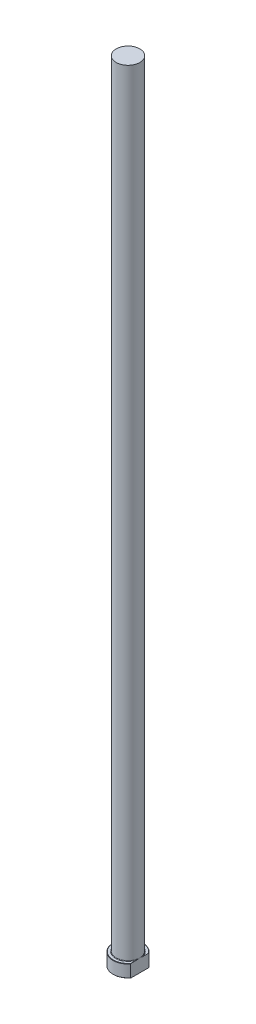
ISO-10303-21;
HEADER;
FILE_DESCRIPTION(('STEP AP214'),'2;1');
FILE_NAME('part.step','',(''),(''),'','','');
FILE_SCHEMA(('AUTOMOTIVE_DESIGN { 1 0 10303 214 1 1 1 1 }'));
ENDSEC;
DATA;
#1=APPLICATION_CONTEXT('core data for automotive mechanical design processes');
#2=APPLICATION_PROTOCOL_DEFINITION('international standard','automotive_design',2000,#1);
#3=PRODUCT_CONTEXT('',#1,'mechanical');
#4=PRODUCT('Part','Part','',(#3));
#5=PRODUCT_RELATED_PRODUCT_CATEGORY('part','',(#4));
#6=PRODUCT_DEFINITION_FORMATION('','',#4);
#7=PRODUCT_DEFINITION_CONTEXT('part definition',#1,'design');
#8=PRODUCT_DEFINITION('design','',#6,#7);
#9=PRODUCT_DEFINITION_SHAPE('','',#8);
#10=(LENGTH_UNIT() NAMED_UNIT(*) SI_UNIT(.MILLI.,.METRE.));
#11=(NAMED_UNIT(*) PLANE_ANGLE_UNIT() SI_UNIT($,.RADIAN.));
#12=(NAMED_UNIT(*) SI_UNIT($,.STERADIAN.) SOLID_ANGLE_UNIT());
#13=UNCERTAINTY_MEASURE_WITH_UNIT(LENGTH_MEASURE(1.E-05),#10,'distance_accuracy_value','');
#14=(GEOMETRIC_REPRESENTATION_CONTEXT(3) GLOBAL_UNCERTAINTY_ASSIGNED_CONTEXT((#13)) GLOBAL_UNIT_ASSIGNED_CONTEXT((#10,
#11,#12)) REPRESENTATION_CONTEXT('',''));
#15=CARTESIAN_POINT('',(0.,0.,0.));
#16=DIRECTION('',(0.,0.,1.));
#17=DIRECTION('',(1.,0.,0.));
#18=AXIS2_PLACEMENT_3D('',#15,#16,#17);
#19=CARTESIAN_POINT('',(0.,0.,0.));
#20=DIRECTION('',(0.,-1.,0.));
#21=DIRECTION('',(0.,0.,-1.));
#22=AXIS2_PLACEMENT_3D('',#19,#20,#21);
#23=PLANE('',#22);
#24=CARTESIAN_POINT('',(0.,0.,0.));
#25=DIRECTION('',(0.,-1.,0.));
#26=DIRECTION('',(0.,0.,-1.));
#27=AXIS2_PLACEMENT_3D('',#24,#25,#26);
#28=CIRCLE('',#27,9.29999999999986);
#29=CARTESIAN_POINT('',(7.49999999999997,0.,5.49909083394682));
#30=VERTEX_POINT('',#29);
#31=CARTESIAN_POINT('',(7.49999999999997,0.,-5.49909083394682));
#32=VERTEX_POINT('',#31);
#33=EDGE_CURVE('E98',#30,#32,#28,.T.);
#34=ORIENTED_EDGE('',*,*,#33,.T.);
#35=DIRECTION('',(0.,0.,1.));
#36=VECTOR('',#35,1.);
#37=CARTESIAN_POINT('',(7.49999999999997,0.,5.83095189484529));
#38=LINE('',#37,#36);
#39=EDGE_CURVE('E83',#32,#30,#38,.T.);
#40=ORIENTED_EDGE('',*,*,#39,.T.);
#41=EDGE_LOOP('',(#34,#40));
#42=FACE_BOUND('',#41,.T.);
#43=ADVANCED_FACE('F32',(#42),#23,.T.);
#44=CARTESIAN_POINT('',(0.,259.958771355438,0.));
#45=DIRECTION('',(0.,1.,0.));
#46=DIRECTION('',(0.,0.,1.));
#47=AXIS2_PLACEMENT_3D('',#44,#45,#46);
#48=CYLINDRICAL_SURFACE('',#47,9.49999999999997);
#49=CARTESIAN_POINT('',(0.,7.79999999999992,0.));
#50=DIRECTION('',(0.,1.,0.));
#51=DIRECTION('',(0.,0.,1.));
#52=AXIS2_PLACEMENT_3D('',#49,#50,#51);
#53=CIRCLE('',#52,9.49999999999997);
#54=CARTESIAN_POINT('',(7.49999999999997,7.79999999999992,5.83095189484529));
#55=VERTEX_POINT('',#54);
#56=CARTESIAN_POINT('',(7.49999999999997,7.79999999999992,-5.83095189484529));
#57=VERTEX_POINT('',#56);
#58=EDGE_CURVE('E104',#55,#57,#53,.F.);
#59=ORIENTED_EDGE('',*,*,#58,.T.);
#60=DIRECTION('',(0.,-1.,0.));
#61=VECTOR('',#60,1.);
#62=CARTESIAN_POINT('',(7.49999999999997,500.,-5.83095189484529));
#63=LINE('',#62,#61);
#64=CARTESIAN_POINT('',(7.49999999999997,0.200000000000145,-5.83095189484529));
#65=VERTEX_POINT('',#64);
#66=EDGE_CURVE('E183',#57,#65,#63,.T.);
#67=ORIENTED_EDGE('',*,*,#66,.T.);
#68=CARTESIAN_POINT('',(0.,0.200000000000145,0.));
#69=DIRECTION('',(0.,-1.,0.));
#70=DIRECTION('',(0.,0.,-1.));
#71=AXIS2_PLACEMENT_3D('',#68,#69,#70);
#72=CIRCLE('',#71,9.49999999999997);
#73=CARTESIAN_POINT('',(7.49999999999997,0.200000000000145,5.83095189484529));
#74=VERTEX_POINT('',#73);
#75=EDGE_CURVE('E100',#65,#74,#72,.F.);
#76=ORIENTED_EDGE('',*,*,#75,.T.);
#77=DIRECTION('',(0.,-1.,0.));
#78=VECTOR('',#77,1.);
#79=CARTESIAN_POINT('',(7.49999999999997,500.,5.83095189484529));
#80=LINE('',#79,#78);
#81=EDGE_CURVE('E93',#55,#74,#80,.T.);
#82=ORIENTED_EDGE('',*,*,#81,.F.);
#83=EDGE_LOOP('',(#59,#67,#76,#82));
#84=FACE_BOUND('',#83,.T.);
#85=ADVANCED_FACE('F158',(#84),#48,.T.);
#86=CARTESIAN_POINT('',(-9.49999999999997,8.,0.));
#87=DIRECTION('',(0.,1.,0.));
#88=DIRECTION('',(0.,0.,1.));
#89=AXIS2_PLACEMENT_3D('',#86,#87,#88);
#90=PLANE('',#89);
#91=CARTESIAN_POINT('',(0.,8.,0.));
#92=DIRECTION('',(0.,1.,0.));
#93=DIRECTION('',(0.,0.,1.));
#94=AXIS2_PLACEMENT_3D('',#91,#92,#93);
#95=CIRCLE('',#94,9.29999999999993);
#96=CARTESIAN_POINT('',(7.49999999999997,8.,-5.49909083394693));
#97=VERTEX_POINT('',#96);
#98=CARTESIAN_POINT('',(7.49999999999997,8.,5.49909083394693));
#99=VERTEX_POINT('',#98);
#100=EDGE_CURVE('E178',#97,#99,#95,.T.);
#101=ORIENTED_EDGE('',*,*,#100,.T.);
#102=DIRECTION('',(0.,0.,-1.));
#103=VECTOR('',#102,1.);
#104=CARTESIAN_POINT('',(7.49999999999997,8.,0.));
#105=LINE('',#104,#103);
#106=CARTESIAN_POINT('',(7.49999999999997,7.99999999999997,2.14242852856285));
#107=VERTEX_POINT('',#106);
#108=EDGE_CURVE('E57',#99,#107,#105,.T.);
#109=ORIENTED_EDGE('',*,*,#108,.T.);
#110=CARTESIAN_POINT('',(0.,8.,0.));
#111=DIRECTION('',(0.,1.,0.));
#112=DIRECTION('',(0.,0.,1.));
#113=AXIS2_PLACEMENT_3D('',#110,#111,#112);
#114=CIRCLE('',#113,7.79999999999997);
#115=CARTESIAN_POINT('',(7.49999999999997,7.99999999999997,-2.14242852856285));
#116=VERTEX_POINT('',#115);
#117=EDGE_CURVE('E107',#107,#116,#114,.F.);
#118=ORIENTED_EDGE('',*,*,#117,.T.);
#119=EDGE_CURVE('E136',#116,#97,#105,.T.);
#120=ORIENTED_EDGE('',*,*,#119,.T.);
#121=EDGE_LOOP('',(#101,#109,#118,#120));
#122=FACE_BOUND('',#121,.T.);
#123=ADVANCED_FACE('F147',(#122),#90,.T.);
#124=CARTESIAN_POINT('',(0.,8.00000000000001,0.));
#125=DIRECTION('',(0.,-1.,0.));
#126=DIRECTION('',(0.,0.,-1.));
#127=AXIS2_PLACEMENT_3D('',#124,#125,#126);
#128=CONICAL_SURFACE('',#127,9.29999999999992,0.785398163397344);
#129=ORIENTED_EDGE('',*,*,#58,.F.);
#130=CARTESIAN_POINT('',(7.49999999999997,2.43926210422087,12.8293230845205));
#131=CARTESIAN_POINT('',(7.49999999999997,2.6036817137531,12.6388640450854));
#132=CARTESIAN_POINT('',(7.49999999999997,2.76757220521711,12.4479485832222));
#133=CARTESIAN_POINT('',(7.49999999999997,3.09414752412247,12.0650837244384));
#134=CARTESIAN_POINT('',(7.49999999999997,3.25683233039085,11.8731343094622));
#135=CARTESIAN_POINT('',(7.49999999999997,3.74300314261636,11.2953796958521));
#136=CARTESIAN_POINT('',(7.49999999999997,4.06444825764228,10.9078497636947));
#137=CARTESIAN_POINT('',(7.49999999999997,4.70797958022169,10.1174567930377));
#138=CARTESIAN_POINT('',(7.49999999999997,5.02989003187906,9.71445035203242));
#139=CARTESIAN_POINT('',(7.49999999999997,5.66358170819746,8.90065355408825));
#140=CARTESIAN_POINT('',(7.49999999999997,5.97536547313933,8.48986519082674));
#141=CARTESIAN_POINT('',(7.49999999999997,6.43271321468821,7.86561279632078));
#142=CARTESIAN_POINT('',(7.49999999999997,6.58355573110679,7.65601562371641));
#143=CARTESIAN_POINT('',(7.49999999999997,6.88098805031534,7.23383023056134));
#144=CARTESIAN_POINT('',(7.49999999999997,7.02757803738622,7.02124214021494));
#145=CARTESIAN_POINT('',(7.49999999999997,7.3157717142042,6.59242303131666));
#146=CARTESIAN_POINT('',(7.49999999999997,7.45737076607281,6.37618888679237));
#147=CARTESIAN_POINT('',(7.49999999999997,7.73432379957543,5.93974874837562));
#148=CARTESIAN_POINT('',(7.49999999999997,7.86967791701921,5.71954284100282));
#149=CARTESIAN_POINT('',(7.49999999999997,8.13161422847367,5.27645352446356));
#150=CARTESIAN_POINT('',(7.49999999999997,8.25826072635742,5.05360831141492));
#151=CARTESIAN_POINT('',(7.49999999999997,8.5022686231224,4.60282545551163));
#152=CARTESIAN_POINT('',(7.49999999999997,8.61962890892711,4.37488720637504));
#153=CARTESIAN_POINT('',(7.49999999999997,8.84265212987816,3.91374424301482));
#154=CARTESIAN_POINT('',(7.49999999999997,8.94833271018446,3.68054813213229));
#155=CARTESIAN_POINT('',(7.49999999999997,9.14543751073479,3.20825593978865));
#156=CARTESIAN_POINT('',(7.49999999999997,9.23686734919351,2.96916222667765));
#157=CARTESIAN_POINT('',(7.49999999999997,9.40433943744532,2.47905851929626));
#158=CARTESIAN_POINT('',(7.49999999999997,9.47995361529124,2.22790013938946));
#159=CARTESIAN_POINT('',(7.49999999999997,9.60922868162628,1.71994305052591));
#160=CARTESIAN_POINT('',(7.49999999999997,9.66289308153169,1.46314525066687));
#161=CARTESIAN_POINT('',(7.49999999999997,9.74472710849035,0.946918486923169));
#162=CARTESIAN_POINT('',(7.49999999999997,9.77303822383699,0.687512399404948));
#163=CARTESIAN_POINT('',(7.49999999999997,9.80263328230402,0.167149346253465));
#164=CARTESIAN_POINT('',(7.49999999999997,9.80391935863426,-0.0938074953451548));
#165=CARTESIAN_POINT('',(7.49999999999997,9.77936899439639,-0.614450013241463));
#166=CARTESIAN_POINT('',(7.49999999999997,9.75352879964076,-0.874135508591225));
#167=CARTESIAN_POINT('',(7.49999999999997,9.67659985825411,-1.38971001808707));
#168=CARTESIAN_POINT('',(7.49999999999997,9.62550644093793,-1.64559832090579));
#169=CARTESIAN_POINT('',(7.49999999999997,9.50084859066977,-2.15357163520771));
#170=CARTESIAN_POINT('',(7.49999999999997,9.42713551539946,-2.4056195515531));
#171=CARTESIAN_POINT('',(7.49999999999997,9.26105658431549,-2.90339454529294));
#172=CARTESIAN_POINT('',(7.49999999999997,9.16869086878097,-3.14912167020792));
#173=CARTESIAN_POINT('',(7.49999999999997,8.94289805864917,-3.69711942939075));
#174=CARTESIAN_POINT('',(7.49999999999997,8.80503243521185,-3.99754721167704));
#175=CARTESIAN_POINT('',(7.49999999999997,8.51100220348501,-4.589388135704));
#176=CARTESIAN_POINT('',(7.49999999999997,8.35482676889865,-4.88079581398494));
#177=CARTESIAN_POINT('',(7.49999999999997,8.02827429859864,-5.45629308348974));
#178=CARTESIAN_POINT('',(7.49999999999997,7.85786790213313,-5.74036587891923));
#179=CARTESIAN_POINT('',(7.49999999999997,7.50643147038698,-6.30173438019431));
#180=CARTESIAN_POINT('',(7.49999999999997,7.32540361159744,-6.57903145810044));
#181=CARTESIAN_POINT('',(7.49999999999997,6.95412130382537,-7.12942244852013));
#182=CARTESIAN_POINT('',(7.49999999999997,6.76382431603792,-7.40248752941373));
#183=CARTESIAN_POINT('',(7.49999999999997,6.37663930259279,-7.9439029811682));
#184=CARTESIAN_POINT('',(7.49999999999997,6.17975101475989,-8.21225316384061));
#185=CARTESIAN_POINT('',(7.49999999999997,5.78094463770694,-8.74469530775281));
#186=CARTESIAN_POINT('',(7.49999999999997,5.57903261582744,-9.00879182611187));
#187=CARTESIAN_POINT('',(7.49999999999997,5.17096183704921,-9.53366660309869));
#188=CARTESIAN_POINT('',(7.49999999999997,4.96480317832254,-9.79444493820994));
#189=CARTESIAN_POINT('',(7.49999999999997,4.56753982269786,-10.2900670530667));
#190=CARTESIAN_POINT('',(7.49999999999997,4.37673236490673,-10.5251495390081));
#191=CARTESIAN_POINT('',(7.49999999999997,3.9926419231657,-10.9933477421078));
#192=CARTESIAN_POINT('',(7.49999999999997,3.7993585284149,-11.2264631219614));
#193=CARTESIAN_POINT('',(7.49999999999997,3.41257456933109,-11.6887329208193));
#194=CARTESIAN_POINT('',(7.49999999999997,3.21909377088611,-11.9179038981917));
#195=CARTESIAN_POINT('',(7.49999999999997,2.83040955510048,-12.3747052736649));
#196=CARTESIAN_POINT('',(7.49999999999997,2.63520647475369,-12.6023359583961));
#197=CARTESIAN_POINT('',(7.49999999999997,2.43926210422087,-12.8293230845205));
#198=B_SPLINE_CURVE_WITH_KNOTS('',3,(#130,#131,#132,#133,#134,#135,#136,#137,#138,#139,#140,
#141,#142,#143,#144,#145,#146,#147,#148,#149,#150,#151,#152,#153,#154,#155,#156,#157,#158,#159,
#160,#161,#162,#163,#164,#165,#166,#167,#168,#169,#170,#171,#172,#173,#174,#175,#176,#177,#178,
#179,#180,#181,#182,#183,#184,#185,#186,#187,#188,#189,#190,#191,#192,#193,#194,#195,#196,#197),
.UNSPECIFIED.,.F.,.F.,(4,2,2,2,2,2,2,2,2,2,2,2,2,2,2,2,2,2,2,2,2,2,2,2,2,2,2,2,2,2,2,2,2,4),(0.,
0.754832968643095,1.50967916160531,3.02009230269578,4.56736183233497,6.11424018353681,
6.88889911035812,7.66352441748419,8.43885153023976,9.2141617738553,9.9829390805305,
10.7518083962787,11.5194997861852,12.2868877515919,13.0729296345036,13.8588457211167,
14.6403480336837,15.4217886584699,16.203337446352,16.9850308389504,17.7719752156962,
18.5589136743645,19.5497136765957,20.5411025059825,21.5345898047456,22.5278742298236,
23.5262502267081,24.5246659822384,25.5219294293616,26.5191698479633,27.4274691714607,
28.3359212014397,29.2356826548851,30.1352717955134),.UNSPECIFIED.);
#199=EDGE_CURVE('E135',#55,#99,#198,.T.);
#200=ORIENTED_EDGE('',*,*,#199,.T.);
#201=ORIENTED_EDGE('',*,*,#100,.F.);
#202=EDGE_CURVE('E127',#97,#57,#198,.T.);
#203=ORIENTED_EDGE('',*,*,#202,.T.);
#204=EDGE_LOOP('',(#129,#200,#201,#203));
#205=FACE_BOUND('',#204,.T.);
#206=ADVANCED_FACE('F143',(#205),#128,.T.);
#207=CARTESIAN_POINT('',(0.,0.200000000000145,0.));
#208=DIRECTION('',(0.,1.,0.));
#209=DIRECTION('',(0.,0.,1.));
#210=AXIS2_PLACEMENT_3D('',#207,#208,#209);
#211=CONICAL_SURFACE('',#210,9.49999999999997,0.785398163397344);
#212=ORIENTED_EDGE('',*,*,#75,.F.);
#213=CARTESIAN_POINT('',(7.49999999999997,5.56073789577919,-12.8293230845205));
#214=CARTESIAN_POINT('',(7.49999999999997,5.39631828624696,-12.6388640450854));
#215=CARTESIAN_POINT('',(7.49999999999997,5.23242779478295,-12.4479485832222));
#216=CARTESIAN_POINT('',(7.49999999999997,4.90585247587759,-12.0650837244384));
#217=CARTESIAN_POINT('',(7.49999999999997,4.74316766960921,-11.8731343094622));
#218=CARTESIAN_POINT('',(7.49999999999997,4.2569968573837,-11.2953796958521));
#219=CARTESIAN_POINT('',(7.49999999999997,3.93555174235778,-10.9078497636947));
#220=CARTESIAN_POINT('',(7.49999999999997,3.29202041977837,-10.1174567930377));
#221=CARTESIAN_POINT('',(7.49999999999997,2.970109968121,-9.71445035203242));
#222=CARTESIAN_POINT('',(7.49999999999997,2.33641829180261,-8.90065355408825));
#223=CARTESIAN_POINT('',(7.49999999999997,2.02463452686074,-8.48986519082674));
#224=CARTESIAN_POINT('',(7.49999999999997,1.56728678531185,-7.86561279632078));
#225=CARTESIAN_POINT('',(7.49999999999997,1.41644426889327,-7.65601562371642));
#226=CARTESIAN_POINT('',(7.49999999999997,1.11901194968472,-7.23383023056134));
#227=CARTESIAN_POINT('',(7.49999999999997,0.972421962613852,-7.02124214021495));
#228=CARTESIAN_POINT('',(7.49999999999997,0.68422828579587,-6.59242303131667));
#229=CARTESIAN_POINT('',(7.49999999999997,0.542629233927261,-6.37618888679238));
#230=CARTESIAN_POINT('',(7.49999999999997,0.26567620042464,-5.93974874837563));
#231=CARTESIAN_POINT('',(7.49999999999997,0.130322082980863,-5.71954284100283));
#232=CARTESIAN_POINT('',(7.49999999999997,-0.131614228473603,-5.27645352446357));
#233=CARTESIAN_POINT('',(7.49999999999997,-0.25826072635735,-5.05360831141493));
#234=CARTESIAN_POINT('',(7.49999999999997,-0.502268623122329,-4.60282545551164));
#235=CARTESIAN_POINT('',(7.49999999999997,-0.619628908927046,-4.37488720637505));
#236=CARTESIAN_POINT('',(7.49999999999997,-0.842652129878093,-3.91374424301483));
#237=CARTESIAN_POINT('',(7.49999999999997,-0.948332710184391,-3.6805481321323));
#238=CARTESIAN_POINT('',(7.49999999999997,-1.14543751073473,-3.20825593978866));
#239=CARTESIAN_POINT('',(7.49999999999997,-1.23686734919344,-2.96916222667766));
#240=CARTESIAN_POINT('',(7.49999999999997,-1.40433943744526,-2.47905851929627));
#241=CARTESIAN_POINT('',(7.49999999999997,-1.47995361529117,-2.22790013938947));
#242=CARTESIAN_POINT('',(7.49999999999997,-1.60922868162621,-1.71994305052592));
#243=CARTESIAN_POINT('',(7.49999999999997,-1.66289308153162,-1.46314525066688));
#244=CARTESIAN_POINT('',(7.49999999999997,-1.74472710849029,-0.946918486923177));
#245=CARTESIAN_POINT('',(7.49999999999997,-1.77303822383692,-0.687512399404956));
#246=CARTESIAN_POINT('',(7.49999999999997,-1.80263328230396,-0.167149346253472));
#247=CARTESIAN_POINT('',(7.49999999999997,-1.80391935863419,0.0938074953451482));
#248=CARTESIAN_POINT('',(7.49999999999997,-1.77936899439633,0.614450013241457));
#249=CARTESIAN_POINT('',(7.49999999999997,-1.7535287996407,0.874135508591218));
#250=CARTESIAN_POINT('',(7.49999999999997,-1.67659985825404,1.38971001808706));
#251=CARTESIAN_POINT('',(7.49999999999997,-1.62550644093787,1.64559832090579));
#252=CARTESIAN_POINT('',(7.49999999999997,-1.5008485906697,2.15357163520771));
#253=CARTESIAN_POINT('',(7.49999999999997,-1.4271355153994,2.40561955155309));
#254=CARTESIAN_POINT('',(7.49999999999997,-1.26105658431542,2.90339454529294));
#255=CARTESIAN_POINT('',(7.49999999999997,-1.1686908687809,3.14912167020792));
#256=CARTESIAN_POINT('',(7.49999999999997,-0.942898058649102,3.69711942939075));
#257=CARTESIAN_POINT('',(7.49999999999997,-0.805032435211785,3.99754721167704));
#258=CARTESIAN_POINT('',(7.49999999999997,-0.511002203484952,4.589388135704));
#259=CARTESIAN_POINT('',(7.49999999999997,-0.354826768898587,4.88079581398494));
#260=CARTESIAN_POINT('',(7.49999999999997,-0.028274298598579,5.45629308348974));
#261=CARTESIAN_POINT('',(7.49999999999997,0.142132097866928,5.74036587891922));
#262=CARTESIAN_POINT('',(7.49999999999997,0.493568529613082,6.30173438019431));
#263=CARTESIAN_POINT('',(7.49999999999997,0.674596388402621,6.57903145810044));
#264=CARTESIAN_POINT('',(7.49999999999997,1.04587869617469,7.12942244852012));
#265=CARTESIAN_POINT('',(7.49999999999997,1.23617568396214,7.40248752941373));
#266=CARTESIAN_POINT('',(7.49999999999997,1.62336069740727,7.9439029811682));
#267=CARTESIAN_POINT('',(7.49999999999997,1.82024898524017,8.2122531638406));
#268=CARTESIAN_POINT('',(7.49999999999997,2.21905536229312,8.74469530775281));
#269=CARTESIAN_POINT('',(7.49999999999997,2.42096738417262,9.00879182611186));
#270=CARTESIAN_POINT('',(7.49999999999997,2.82903816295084,9.53366660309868));
#271=CARTESIAN_POINT('',(7.49999999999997,3.03519682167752,9.79444493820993));
#272=CARTESIAN_POINT('',(7.49999999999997,3.4324601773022,10.2900670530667));
#273=CARTESIAN_POINT('',(7.49999999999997,3.62326763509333,10.5251495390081));
#274=CARTESIAN_POINT('',(7.49999999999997,4.00735807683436,10.9933477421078));
#275=CARTESIAN_POINT('',(7.49999999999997,4.20064147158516,11.2264631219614));
#276=CARTESIAN_POINT('',(7.49999999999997,4.58742543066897,11.6887329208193));
#277=CARTESIAN_POINT('',(7.49999999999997,4.78090622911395,11.9179038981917));
#278=CARTESIAN_POINT('',(7.49999999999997,5.16959044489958,12.3747052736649));
#279=CARTESIAN_POINT('',(7.49999999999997,5.36479352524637,12.6023359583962));
#280=CARTESIAN_POINT('',(7.49999999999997,5.56073789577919,12.8293230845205));
#281=B_SPLINE_CURVE_WITH_KNOTS('',3,(#213,#214,#215,#216,#217,#218,#219,#220,#221,#222,#223,
#224,#225,#226,#227,#228,#229,#230,#231,#232,#233,#234,#235,#236,#237,#238,#239,#240,#241,#242,
#243,#244,#245,#246,#247,#248,#249,#250,#251,#252,#253,#254,#255,#256,#257,#258,#259,#260,#261,
#262,#263,#264,#265,#266,#267,#268,#269,#270,#271,#272,#273,#274,#275,#276,#277,#278,#279,#280),
.UNSPECIFIED.,.F.,.F.,(4,2,2,2,2,2,2,2,2,2,2,2,2,2,2,2,2,2,2,2,2,2,2,2,2,2,2,2,2,2,2,2,2,4),(0.,
0.754832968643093,1.50967916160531,3.02009230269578,4.56736183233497,6.1142401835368,
6.88889911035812,7.66352441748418,8.43885153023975,9.2141617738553,9.98293908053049,
10.7518083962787,11.5194997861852,12.2868877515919,13.0729296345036,13.8588457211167,
14.6403480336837,15.4217886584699,16.203337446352,16.9850308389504,17.7719752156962,
18.5589136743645,19.5497136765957,20.5411025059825,21.5345898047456,22.5278742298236,
23.5262502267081,24.5246659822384,25.5219294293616,26.5191698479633,27.4274691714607,
28.3359212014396,29.2356826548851,30.1352717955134),.UNSPECIFIED.);
#282=EDGE_CURVE('E86',#65,#32,#281,.T.);
#283=ORIENTED_EDGE('',*,*,#282,.T.);
#284=ORIENTED_EDGE('',*,*,#33,.F.);
#285=EDGE_CURVE('E89',#30,#74,#281,.T.);
#286=ORIENTED_EDGE('',*,*,#285,.T.);
#287=EDGE_LOOP('',(#212,#283,#284,#286));
#288=FACE_BOUND('',#287,.T.);
#289=ADVANCED_FACE('F97',(#288),#211,.T.);
#290=CARTESIAN_POINT('',(0.,8.29999999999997,0.));
#291=DIRECTION('',(0.,1.,0.));
#292=DIRECTION('',(0.,0.,1.));
#293=AXIS2_PLACEMENT_3D('',#290,#291,#292);
#294=TOROIDAL_SURFACE('',#293,7.79999999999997,0.3);
#295=CARTESIAN_POINT('',(7.49999999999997,8.29999999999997,0.));
#296=CARTESIAN_POINT('',(7.49999999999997,8.300000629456,-6.51608939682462E-11));
#297=CARTESIAN_POINT('',(7.49999999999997,8.30000125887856,-3.32214421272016E-07));
#298=CARTESIAN_POINT('',(7.49999999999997,8.30000242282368,-1.19350016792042E-06));
#299=CARTESIAN_POINT('',(7.49999999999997,8.300002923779,-1.74631658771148E-06));
#300=CARTESIAN_POINT('',(7.49999999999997,8.3000040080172,-3.08939560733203E-06));
#301=CARTESIAN_POINT('',(7.49999999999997,8.30000457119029,-3.9012580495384E-06));
#302=CARTESIAN_POINT('',(7.49999999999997,8.3000055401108,-5.54513098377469E-06));
#303=CARTESIAN_POINT('',(7.49999999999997,8.30000595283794,-6.37354880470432E-06));
#304=CARTESIAN_POINT('',(7.49999999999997,8.3000075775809,-9.72270005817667E-06));
#305=CARTESIAN_POINT('',(7.49999999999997,8.3000087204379,-1.22823396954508E-05));
#306=CARTESIAN_POINT('',(7.49999999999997,8.30001050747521,-1.72397139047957E-05));
#307=CARTESIAN_POINT('',(7.49999999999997,8.30001119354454,-1.96228301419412E-05));
#308=CARTESIAN_POINT('',(7.49999999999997,8.30001422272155,-3.00782508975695E-05));
#309=CARTESIAN_POINT('',(7.49999999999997,8.30001660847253,-3.81393987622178E-05));
#310=CARTESIAN_POINT('',(7.49999999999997,8.3000199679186,-5.3104393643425E-05));
#311=CARTESIAN_POINT('',(7.49999999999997,8.30002111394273,-5.99687184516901E-05));
#312=CARTESIAN_POINT('',(7.49999999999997,8.3000296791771,-0.000111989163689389));
#313=CARTESIAN_POINT('',(7.49999999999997,8.30003643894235,-0.000157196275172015));
#314=CARTESIAN_POINT('',(7.49999999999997,8.30006598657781,-0.000337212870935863));
#315=CARTESIAN_POINT('',(7.49999999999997,8.30009388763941,-0.000471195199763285));
#316=CARTESIAN_POINT('',(7.49999999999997,8.30020349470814,-0.00100522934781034));
#317=CARTESIAN_POINT('',(7.49999999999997,8.30028210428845,-0.00140568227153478));
#318=CARTESIAN_POINT('',(7.49999999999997,8.30059879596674,-0.00300848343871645));
#319=CARTESIAN_POINT('',(7.49999999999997,8.30084089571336,-0.00421028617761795));
#320=CARTESIAN_POINT('',(7.49999999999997,8.30185756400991,-0.00926899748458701));
#321=CARTESIAN_POINT('',(7.49999999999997,8.30262698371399,-0.0131266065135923));
#322=CARTESIAN_POINT('',(7.49999999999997,8.30886607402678,-0.0443917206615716));
#323=CARTESIAN_POINT('',(7.49999999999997,8.3143542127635,-0.0717967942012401));
#324=CARTESIAN_POINT('',(7.49999999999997,8.32508136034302,-0.125492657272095));
#325=CARTESIAN_POINT('',(7.49999999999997,8.33032139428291,-0.151783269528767));
#326=CARTESIAN_POINT('',(7.49999999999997,8.34743165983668,-0.237826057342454));
#327=CARTESIAN_POINT('',(7.49999999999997,8.35925409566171,-0.297588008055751));
#328=CARTESIAN_POINT('',(7.49999999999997,8.37915045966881,-0.39932695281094));
#329=CARTESIAN_POINT('',(7.49999999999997,8.38729050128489,-0.441291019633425));
#330=CARTESIAN_POINT('',(7.49999999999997,8.40317766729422,-0.524107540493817));
#331=CARTESIAN_POINT('',(7.49999999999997,8.41092945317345,-0.564959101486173));
#332=CARTESIAN_POINT('',(7.49999999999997,8.43606132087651,-0.699267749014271));
#333=CARTESIAN_POINT('',(7.49999999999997,8.45300209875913,-0.792808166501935));
#334=CARTESIAN_POINT('',(7.49999999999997,8.4853816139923,-0.981070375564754));
#335=CARTESIAN_POINT('',(7.49999999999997,8.50080449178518,-1.07579492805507));
#336=CARTESIAN_POINT('',(7.49999999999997,8.53061055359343,-1.27446475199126));
#337=CARTESIAN_POINT('',(7.49999999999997,8.54476231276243,-1.37844538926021));
#338=CARTESIAN_POINT('',(7.49999999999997,8.56909710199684,-1.58661369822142));
#339=CARTESIAN_POINT('',(7.49999999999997,8.57929047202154,-1.69080010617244));
#340=CARTESIAN_POINT('',(7.49999999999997,8.59298930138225,-1.88228488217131));
#341=CARTESIAN_POINT('',(7.49999999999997,8.59732286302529,-1.9695221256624));
#342=CARTESIAN_POINT('',(7.49999999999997,8.60087759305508,-2.14306718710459));
#343=CARTESIAN_POINT('',(7.49999999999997,8.6001615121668,-2.22937311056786));
#344=CARTESIAN_POINT('',(7.49999999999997,8.59376191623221,-2.35935646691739));
#345=CARTESIAN_POINT('',(7.49999999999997,8.59068958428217,-2.40316119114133));
#346=CARTESIAN_POINT('',(7.49999999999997,8.58226872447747,-2.49054555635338));
#347=CARTESIAN_POINT('',(7.49999999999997,8.57692118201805,-2.53412528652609));
#348=CARTESIAN_POINT('',(7.49999999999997,8.56333073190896,-2.62065295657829));
#349=CARTESIAN_POINT('',(7.49999999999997,8.5550999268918,-2.66360276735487));
#350=CARTESIAN_POINT('',(7.49999999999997,8.53472465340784,-2.74854138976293));
#351=CARTESIAN_POINT('',(7.49999999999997,8.52258966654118,-2.79053226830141));
#352=CARTESIAN_POINT('',(7.49999999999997,8.50172019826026,-2.84707626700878));
#353=CARTESIAN_POINT('',(7.49999999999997,8.49551412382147,-2.8625585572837));
#354=CARTESIAN_POINT('',(7.49999999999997,8.48199003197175,-2.89312455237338));
#355=CARTESIAN_POINT('',(7.49999999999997,8.47466699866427,-2.90820607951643));
#356=CARTESIAN_POINT('',(7.49999999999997,8.45643733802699,-2.94176638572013));
#357=CARTESIAN_POINT('',(7.49999999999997,8.44510130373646,-2.96001524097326));
#358=CARTESIAN_POINT('',(7.49999999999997,8.41939194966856,-2.99422798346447));
#359=CARTESIAN_POINT('',(7.49999999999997,8.4050458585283,-3.01021033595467));
#360=CARTESIAN_POINT('',(7.49999999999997,8.38277024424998,-3.02862370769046));
#361=CARTESIAN_POINT('',(7.49999999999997,8.37661626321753,-3.03317774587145));
#362=CARTESIAN_POINT('',(7.49999999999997,8.36374726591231,-3.04142849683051));
#363=CARTESIAN_POINT('',(7.49999999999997,8.35703226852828,-3.04512523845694));
#364=CARTESIAN_POINT('',(7.49999999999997,8.34300168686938,-3.05142978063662));
#365=CARTESIAN_POINT('',(7.49999999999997,8.33567999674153,-3.05402433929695));
#366=CARTESIAN_POINT('',(7.49999999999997,8.32067723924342,-3.0577725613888));
#367=CARTESIAN_POINT('',(7.49999999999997,8.31299680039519,-3.05892865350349));
#368=CARTESIAN_POINT('',(7.49999999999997,8.29831958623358,-3.05961341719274));
#369=CARTESIAN_POINT('',(7.49999999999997,8.29132960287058,-3.05929052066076));
#370=CARTESIAN_POINT('',(7.49999999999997,8.27752221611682,-3.05739055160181));
#371=CARTESIAN_POINT('',(7.49999999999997,8.27070493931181,-3.05581258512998));
#372=CARTESIAN_POINT('',(7.49999999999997,8.2562073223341,-3.05117468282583));
#373=CARTESIAN_POINT('',(7.49999999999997,8.24859804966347,-3.04789600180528));
#374=CARTESIAN_POINT('',(7.49999999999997,8.23400879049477,-3.04015890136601));
#375=CARTESIAN_POINT('',(7.49999999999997,8.22702999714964,-3.03569830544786));
#376=CARTESIAN_POINT('',(7.49999999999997,8.20976516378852,-3.02301537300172));
#377=CARTESIAN_POINT('',(7.49999999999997,8.19997105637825,-3.01413059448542));
#378=CARTESIAN_POINT('',(7.49999999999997,8.18178554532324,-2.99503464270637));
#379=CARTESIAN_POINT('',(7.49999999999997,8.17339834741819,-2.98481964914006));
#380=CARTESIAN_POINT('',(7.49999999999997,8.14970146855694,-2.9526252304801));
#381=CARTESIAN_POINT('',(7.49999999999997,8.13615721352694,-2.92936338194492));
#382=CARTESIAN_POINT('',(7.49999999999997,8.11220294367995,-2.88135712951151));
#383=CARTESIAN_POINT('',(7.49999999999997,8.10179775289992,-2.85661051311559));
#384=CARTESIAN_POINT('',(7.49999999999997,8.07794671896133,-2.79198140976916));
#385=CARTESIAN_POINT('',(7.49999999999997,8.06614015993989,-2.75149952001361));
#386=CARTESIAN_POINT('',(7.49999999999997,8.04620440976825,-2.6696131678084));
#387=CARTESIAN_POINT('',(7.49999999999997,8.03808385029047,-2.62820677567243));
#388=CARTESIAN_POINT('',(7.49999999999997,8.0244826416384,-2.54425246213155));
#389=CARTESIAN_POINT('',(7.49999999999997,8.01904890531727,-2.50169707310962));
#390=CARTESIAN_POINT('',(7.49999999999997,8.01040845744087,-2.41643636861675));
#391=CARTESIAN_POINT('',(7.49999999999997,8.0071984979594,-2.37373136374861));
#392=CARTESIAN_POINT('',(7.49999999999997,8.00037885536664,-2.24806301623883));
#393=CARTESIAN_POINT('',(7.49999999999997,7.9992264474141,-2.16496751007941));
#394=CARTESIAN_POINT('',(7.49999999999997,8.0016716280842,-1.99883156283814));
#395=CARTESIAN_POINT('',(7.49999999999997,8.00527261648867,-1.91579120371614));
#396=CARTESIAN_POINT('',(7.49999999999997,8.01608795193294,-1.74953934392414));
#397=CARTESIAN_POINT('',(7.49999999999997,8.02332021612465,-1.66632905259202));
#398=CARTESIAN_POINT('',(7.49999999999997,8.04056777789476,-1.50019368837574));
#399=CARTESIAN_POINT('',(7.49999999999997,8.05058351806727,-1.41726866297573));
#400=CARTESIAN_POINT('',(7.49999999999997,8.08166776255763,-1.18510145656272));
#401=CARTESIAN_POINT('',(7.49999999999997,8.10514521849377,-1.03618592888));
#402=CARTESIAN_POINT('',(7.49999999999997,8.15592126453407,-0.740890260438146));
#403=CARTESIAN_POINT('',(7.49999999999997,8.18317032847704,-0.594501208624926));
#404=CARTESIAN_POINT('',(7.49999999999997,8.217112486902,-0.418623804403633));
#405=CARTESIAN_POINT('',(7.49999999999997,8.22287977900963,-0.388953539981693));
#406=CARTESIAN_POINT('',(7.49999999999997,8.23465044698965,-0.328749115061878));
#407=CARTESIAN_POINT('',(7.49999999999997,8.24065576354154,-0.298215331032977));
#408=CARTESIAN_POINT('',(7.49999999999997,8.25537547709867,-0.223678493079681));
#409=CARTESIAN_POINT('',(7.49999999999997,8.26411534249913,-0.179680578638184));
#410=CARTESIAN_POINT('',(7.49999999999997,8.28078486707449,-0.096118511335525));
#411=CARTESIAN_POINT('',(7.49999999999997,8.28870768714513,-0.0565531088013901));
#412=CARTESIAN_POINT('',(7.49999999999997,8.29737199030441,-0.0131314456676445));
#413=CARTESIAN_POINT('',(7.49999999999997,8.2981404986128,-0.00927869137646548));
#414=CARTESIAN_POINT('',(7.49999999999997,8.29915695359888,-0.00422106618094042));
#415=CARTESIAN_POINT('',(7.49999999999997,8.29939980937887,-0.00301550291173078));
#416=CARTESIAN_POINT('',(7.49999999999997,8.29971742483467,-0.00140802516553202));
#417=CARTESIAN_POINT('',(7.49999999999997,8.29979621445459,-0.00100665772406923));
#418=CARTESIAN_POINT('',(7.49999999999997,8.29990603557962,-0.000471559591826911));
#419=CARTESIAN_POINT('',(7.49999999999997,8.29993396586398,-0.000337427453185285));
#420=CARTESIAN_POINT('',(7.49999999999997,8.29996354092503,-0.000157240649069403));
#421=CARTESIAN_POINT('',(7.49999999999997,8.29997030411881,-0.000112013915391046));
#422=CARTESIAN_POINT('',(7.49999999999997,8.29997887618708,-5.99732624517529E-05));
#423=CARTESIAN_POINT('',(7.49999999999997,8.29998002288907,-5.31079755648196E-05));
#424=CARTESIAN_POINT('',(7.49999999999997,8.29998338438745,-3.81408960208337E-05));
#425=CARTESIAN_POINT('',(7.49999999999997,8.29998577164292,-3.00786736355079E-05));
#426=CARTESIAN_POINT('',(7.49999999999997,8.29998880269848,-1.96221109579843E-05));
#427=CARTESIAN_POINT('',(7.49999999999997,8.29998948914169,-1.72389248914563E-05));
#428=CARTESIAN_POINT('',(7.49999999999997,8.29999127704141,-1.22814610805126E-05));
#429=CARTESIAN_POINT('',(7.49999999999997,8.29999242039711,-9.72181208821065E-06));
#430=CARTESIAN_POINT('',(7.49999999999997,8.29999404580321,-6.37270599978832E-06));
#431=CARTESIAN_POINT('',(7.49999999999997,8.29999445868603,-5.54432175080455E-06));
#432=CARTESIAN_POINT('',(7.49999999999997,8.29999542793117,-3.90054399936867E-06));
#433=CARTESIAN_POINT('',(7.49999999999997,8.29999599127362,-3.08874491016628E-06));
#434=CARTESIAN_POINT('',(7.49999999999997,8.2999970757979,-1.74580874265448E-06));
#435=CARTESIAN_POINT('',(7.49999999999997,8.29999757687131,-1.19306551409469E-06));
#436=CARTESIAN_POINT('',(7.49999999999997,8.29999874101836,-3.31972816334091E-07));
#437=CARTESIAN_POINT('',(7.49999999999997,8.2999993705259,6.51627621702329E-11));
#438=CARTESIAN_POINT('',(7.49999999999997,8.29999999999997,0.));
#439=B_SPLINE_CURVE_WITH_KNOTS('',3,(#295,#296,#297,#298,#299,#300,#301,#302,#303,#304,#305,
#306,#307,#308,#309,#310,#311,#312,#313,#314,#315,#316,#317,#318,#319,#320,#321,#322,#323,#324,
#325,#326,#327,#328,#329,#330,#331,#332,#333,#334,#335,#336,#337,#338,#339,#340,#341,#342,#343,
#344,#345,#346,#347,#348,#349,#350,#351,#352,#353,#354,#355,#356,#357,#358,#359,#360,#361,#362,
#363,#364,#365,#366,#367,#368,#369,#370,#371,#372,#373,#374,#375,#376,#377,#378,#379,#380,#381,
#382,#383,#384,#385,#386,#387,#388,#389,#390,#391,#392,#393,#394,#395,#396,#397,#398,#399,#400,
#401,#402,#403,#404,#405,#406,#407,#408,#409,#410,#411,#412,#413,#414,#415,#416,#417,#418,#419,
#420,#421,#422,#423,#424,#425,#426,#427,#428,#429,#430,#431,#432,#433,#434,#435,#436,#437,#438),
.UNSPECIFIED.,.T.,.F.,(4,2,2,2,2,2,2,2,2,2,2,2,2,2,2,2,2,2,2,2,2,2,2,2,2,2,2,2,2,2,2,2,2,2,2,2,
2,2,2,2,2,2,2,2,2,2,2,2,2,2,2,2,2,2,2,2,2,2,2,2,2,2,2,2,2,2,2,2,2,2,2,4),(0.,
1.9384049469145E-06,4.20157043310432E-06,7.1407950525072E-06,9.91759459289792E-06,
1.83023461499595E-05,2.57350155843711E-05,5.09261821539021E-05,7.17829568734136E-05,
0.000208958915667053,0.000619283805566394,0.00184383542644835,0.00552134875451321,
0.0173225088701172,0.101168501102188,0.181592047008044,0.364351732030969,0.492590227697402,
0.617331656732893,0.902507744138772,1.19040258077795,1.50517027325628,1.81911011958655,
2.08105007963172,2.33974076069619,2.47143532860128,2.60307291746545,2.73416444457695,
2.86493997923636,2.91494951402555,2.9651906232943,3.0294869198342,3.09322490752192,
3.11613866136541,3.13905164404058,3.1622326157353,3.18537439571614,3.20624749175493,
3.22713546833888,3.25185494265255,3.27662025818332,3.31606664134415,3.35562891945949,
3.4359311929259,3.51635625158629,3.64254883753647,3.76903542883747,3.89765873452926,
4.02609378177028,4.27518242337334,4.52444931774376,4.77495839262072,5.02550732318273,
5.4776529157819,5.92434268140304,6.01501954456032,6.10837554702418,6.24294897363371,
6.36399919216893,6.37578552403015,6.37947454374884,6.38070189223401,6.38111267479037,
6.3812499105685,6.38127077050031,6.38129596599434,6.38130339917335,6.38131178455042,
6.38131456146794,6.38131750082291,6.38131976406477,6.38132170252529),.UNSPECIFIED.);
#440=CARTESIAN_POINT('',(7.49999999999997,8.29999999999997,0.));
#441=VERTEX_POINT('',#440);
#442=EDGE_CURVE('E11',#116,#441,#439,.T.);
#443=ORIENTED_EDGE('',*,*,#442,.F.);
#444=ORIENTED_EDGE('',*,*,#117,.F.);
#445=CARTESIAN_POINT('',(7.49999999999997,8.29999999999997,0.));
#446=CARTESIAN_POINT('',(7.49999999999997,8.29999937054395,6.5160089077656E-11));
#447=CARTESIAN_POINT('',(7.49999999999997,8.29999874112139,3.32214420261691E-07));
#448=CARTESIAN_POINT('',(7.49999999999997,8.29999757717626,1.1935001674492E-06));
#449=CARTESIAN_POINT('',(7.49999999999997,8.29999707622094,1.7463165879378E-06));
#450=CARTESIAN_POINT('',(7.49999999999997,8.29999599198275,3.08939560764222E-06));
#451=CARTESIAN_POINT('',(7.49999999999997,8.29999542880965,3.90125804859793E-06));
#452=CARTESIAN_POINT('',(7.49999999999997,8.29999445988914,5.54513098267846E-06));
#453=CARTESIAN_POINT('',(7.49999999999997,8.29999404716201,6.37354880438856E-06));
#454=CARTESIAN_POINT('',(7.49999999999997,8.29999242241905,9.72270006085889E-06));
#455=CARTESIAN_POINT('',(7.49999999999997,8.29999127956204,1.22823396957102E-05));
#456=CARTESIAN_POINT('',(7.49999999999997,8.29998949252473,1.7239713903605E-05));
#457=CARTESIAN_POINT('',(7.49999999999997,8.2999888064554,1.96228301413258E-05));
#458=CARTESIAN_POINT('',(7.49999999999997,8.2999857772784,3.0078250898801E-05));
#459=CARTESIAN_POINT('',(7.49999999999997,8.29998339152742,3.81393987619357E-05));
#460=CARTESIAN_POINT('',(7.49999999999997,8.29998003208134,5.31043936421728E-05));
#461=CARTESIAN_POINT('',(7.49999999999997,8.29997888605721,5.99687184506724E-05));
#462=CARTESIAN_POINT('',(7.49999999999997,8.29997032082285,0.000111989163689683));
#463=CARTESIAN_POINT('',(7.49999999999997,8.29996356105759,0.000157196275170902));
#464=CARTESIAN_POINT('',(7.49999999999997,8.29993401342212,0.000337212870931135));
#465=CARTESIAN_POINT('',(7.49999999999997,8.29990611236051,0.000471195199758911));
#466=CARTESIAN_POINT('',(7.49999999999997,8.29979650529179,0.00100522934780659));
#467=CARTESIAN_POINT('',(7.49999999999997,8.29971789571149,0.0014056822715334));
#468=CARTESIAN_POINT('',(7.49999999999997,8.29940120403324,0.003008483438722));
#469=CARTESIAN_POINT('',(7.49999999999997,8.2991591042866,0.00421028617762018));
#470=CARTESIAN_POINT('',(7.49999999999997,8.29814243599,0.00926899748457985));
#471=CARTESIAN_POINT('',(7.49999999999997,8.29737301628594,0.0131266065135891));
#472=CARTESIAN_POINT('',(7.49999999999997,8.29113392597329,0.0443917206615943));
#473=CARTESIAN_POINT('',(7.49999999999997,8.28564578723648,0.0717967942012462));
#474=CARTESIAN_POINT('',(7.49999999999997,8.27491863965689,0.125492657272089));
#475=CARTESIAN_POINT('',(7.49999999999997,8.26967860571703,0.151783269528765));
#476=CARTESIAN_POINT('',(7.49999999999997,8.2525683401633,0.237826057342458));
#477=CARTESIAN_POINT('',(7.49999999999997,8.24074590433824,0.297588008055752));
#478=CARTESIAN_POINT('',(7.49999999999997,8.22084954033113,0.399326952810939));
#479=CARTESIAN_POINT('',(7.49999999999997,8.21270949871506,0.441291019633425));
#480=CARTESIAN_POINT('',(7.49999999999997,8.19682233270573,0.524107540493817));
#481=CARTESIAN_POINT('',(7.49999999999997,8.1890705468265,0.564959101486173));
#482=CARTESIAN_POINT('',(7.49999999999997,8.16393867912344,0.699267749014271));
#483=CARTESIAN_POINT('',(7.49999999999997,8.14699790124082,0.792808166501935));
#484=CARTESIAN_POINT('',(7.49999999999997,8.11461838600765,0.981070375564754));
#485=CARTESIAN_POINT('',(7.49999999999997,8.09919550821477,1.07579492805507));
#486=CARTESIAN_POINT('',(7.49999999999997,8.06938944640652,1.27446475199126));
#487=CARTESIAN_POINT('',(7.49999999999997,8.05523768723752,1.37844538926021));
#488=CARTESIAN_POINT('',(7.49999999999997,8.03090289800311,1.58661369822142));
#489=CARTESIAN_POINT('',(7.49999999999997,8.02070952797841,1.69080010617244));
#490=CARTESIAN_POINT('',(7.49999999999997,8.0070106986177,1.88228488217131));
#491=CARTESIAN_POINT('',(7.49999999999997,8.00267713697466,1.9695221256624));
#492=CARTESIAN_POINT('',(7.49999999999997,7.99912240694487,2.14306718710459));
#493=CARTESIAN_POINT('',(7.49999999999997,7.99983848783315,2.22937311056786));
#494=CARTESIAN_POINT('',(7.49999999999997,8.00623808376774,2.35935646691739));
#495=CARTESIAN_POINT('',(7.49999999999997,8.00931041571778,2.40316119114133));
#496=CARTESIAN_POINT('',(7.49999999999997,8.01773127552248,2.49054555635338));
#497=CARTESIAN_POINT('',(7.49999999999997,8.0230788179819,2.53412528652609));
#498=CARTESIAN_POINT('',(7.49999999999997,8.03666926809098,2.62065295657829));
#499=CARTESIAN_POINT('',(7.49999999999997,8.04490007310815,2.66360276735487));
#500=CARTESIAN_POINT('',(7.49999999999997,8.06527534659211,2.74854138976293));
#501=CARTESIAN_POINT('',(7.49999999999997,8.07741033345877,2.79053226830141));
#502=CARTESIAN_POINT('',(7.49999999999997,8.09827980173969,2.84707626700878));
#503=CARTESIAN_POINT('',(7.49999999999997,8.10448587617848,2.8625585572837));
#504=CARTESIAN_POINT('',(7.49999999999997,8.1180099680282,2.89312455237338));
#505=CARTESIAN_POINT('',(7.49999999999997,8.12533300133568,2.90820607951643));
#506=CARTESIAN_POINT('',(7.49999999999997,8.14356266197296,2.94176638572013));
#507=CARTESIAN_POINT('',(7.49999999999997,8.15489869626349,2.96001524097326));
#508=CARTESIAN_POINT('',(7.49999999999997,8.18060805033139,2.99422798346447));
#509=CARTESIAN_POINT('',(7.49999999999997,8.19495414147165,3.01021033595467));
#510=CARTESIAN_POINT('',(7.49999999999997,8.21722975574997,3.02862370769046));
#511=CARTESIAN_POINT('',(7.49999999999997,8.22338373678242,3.03317774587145));
#512=CARTESIAN_POINT('',(7.49999999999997,8.23625273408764,3.04142849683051));
#513=CARTESIAN_POINT('',(7.49999999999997,8.24296773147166,3.04512523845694));
#514=CARTESIAN_POINT('',(7.49999999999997,8.25699831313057,3.05142978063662));
#515=CARTESIAN_POINT('',(7.49999999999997,8.26432000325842,3.05402433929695));
#516=CARTESIAN_POINT('',(7.49999999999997,8.27932276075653,3.0577725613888));
#517=CARTESIAN_POINT('',(7.49999999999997,8.28700319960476,3.05892865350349));
#518=CARTESIAN_POINT('',(7.49999999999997,8.30168041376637,3.05961341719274));
#519=CARTESIAN_POINT('',(7.49999999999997,8.30867039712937,3.05929052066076));
#520=CARTESIAN_POINT('',(7.49999999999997,8.32247778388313,3.05739055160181));
#521=CARTESIAN_POINT('',(7.49999999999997,8.32929506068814,3.05581258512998));
#522=CARTESIAN_POINT('',(7.49999999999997,8.34379267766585,3.05117468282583));
#523=CARTESIAN_POINT('',(7.49999999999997,8.35140195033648,3.04789600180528));
#524=CARTESIAN_POINT('',(7.49999999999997,8.36599120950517,3.04015890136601));
#525=CARTESIAN_POINT('',(7.49999999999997,8.37297000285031,3.03569830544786));
#526=CARTESIAN_POINT('',(7.49999999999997,8.39023483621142,3.02301537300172));
#527=CARTESIAN_POINT('',(7.49999999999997,8.4000289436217,3.01413059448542));
#528=CARTESIAN_POINT('',(7.49999999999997,8.41821445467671,2.99503464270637));
#529=CARTESIAN_POINT('',(7.49999999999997,8.42660165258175,2.98481964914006));
#530=CARTESIAN_POINT('',(7.49999999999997,8.45029853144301,2.9526252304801));
#531=CARTESIAN_POINT('',(7.49999999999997,8.46384278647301,2.92936338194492));
#532=CARTESIAN_POINT('',(7.49999999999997,8.48779705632,2.88135712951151));
#533=CARTESIAN_POINT('',(7.49999999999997,8.49820224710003,2.85661051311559));
#534=CARTESIAN_POINT('',(7.49999999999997,8.52205328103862,2.79198140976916));
#535=CARTESIAN_POINT('',(7.49999999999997,8.53385984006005,2.75149952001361));
#536=CARTESIAN_POINT('',(7.49999999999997,8.5537955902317,2.6696131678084));
#537=CARTESIAN_POINT('',(7.49999999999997,8.56191614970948,2.62820677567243));
#538=CARTESIAN_POINT('',(7.49999999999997,8.57551735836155,2.54425246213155));
#539=CARTESIAN_POINT('',(7.49999999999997,8.58095109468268,2.50169707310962));
#540=CARTESIAN_POINT('',(7.49999999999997,8.58959154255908,2.41643636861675));
#541=CARTESIAN_POINT('',(7.49999999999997,8.59280150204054,2.37373136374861));
#542=CARTESIAN_POINT('',(7.49999999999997,8.59962114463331,2.24806301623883));
#543=CARTESIAN_POINT('',(7.49999999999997,8.60077355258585,2.16496751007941));
#544=CARTESIAN_POINT('',(7.49999999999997,8.59832837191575,1.99883156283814));
#545=CARTESIAN_POINT('',(7.49999999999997,8.59472738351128,1.91579120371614));
#546=CARTESIAN_POINT('',(7.49999999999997,8.58391204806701,1.74953934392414));
#547=CARTESIAN_POINT('',(7.49999999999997,8.5766797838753,1.66632905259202));
#548=CARTESIAN_POINT('',(7.49999999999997,8.55943222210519,1.50019368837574));
#549=CARTESIAN_POINT('',(7.49999999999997,8.54941648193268,1.41726866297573));
#550=CARTESIAN_POINT('',(7.49999999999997,8.51833223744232,1.18510145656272));
#551=CARTESIAN_POINT('',(7.49999999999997,8.49485478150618,1.03618592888));
#552=CARTESIAN_POINT('',(7.49999999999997,8.44407873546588,0.740890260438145));
#553=CARTESIAN_POINT('',(7.49999999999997,8.41682967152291,0.594501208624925));
#554=CARTESIAN_POINT('',(7.49999999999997,8.38288751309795,0.418623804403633));
#555=CARTESIAN_POINT('',(7.49999999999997,8.37712022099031,0.388953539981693));
#556=CARTESIAN_POINT('',(7.49999999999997,8.3653495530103,0.328749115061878));
#557=CARTESIAN_POINT('',(7.49999999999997,8.35934423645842,0.298215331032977));
#558=CARTESIAN_POINT('',(7.49999999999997,8.34462452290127,0.223678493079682));
#559=CARTESIAN_POINT('',(7.49999999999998,8.3358846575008,0.179680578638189));
#560=CARTESIAN_POINT('',(7.49999999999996,8.31921513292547,0.0961185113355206));
#561=CARTESIAN_POINT('',(7.49999999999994,8.31129231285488,0.0565531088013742));
#562=CARTESIAN_POINT('',(7.49999999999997,8.30262800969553,0.0131314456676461));
#563=CARTESIAN_POINT('',(7.49999999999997,8.30185950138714,0.00927869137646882));
#564=CARTESIAN_POINT('',(7.49999999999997,8.30084304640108,0.00422106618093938));
#565=CARTESIAN_POINT('',(7.49999999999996,8.30060019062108,0.00301550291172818));
#566=CARTESIAN_POINT('',(7.49999999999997,8.30028257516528,0.00140802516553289));
#567=CARTESIAN_POINT('',(7.49999999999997,8.30020378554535,0.00100665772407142));
#568=CARTESIAN_POINT('',(7.49999999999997,8.30009396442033,0.000471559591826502));
#569=CARTESIAN_POINT('',(7.49999999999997,8.30006603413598,0.000337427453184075));
#570=CARTESIAN_POINT('',(7.49999999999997,8.30003645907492,0.00015724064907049));
#571=CARTESIAN_POINT('',(7.49999999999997,8.30002969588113,0.000112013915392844));
#572=CARTESIAN_POINT('',(7.49999999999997,8.30002112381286,5.99732624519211E-05));
#573=CARTESIAN_POINT('',(7.49999999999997,8.30001997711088,5.31079755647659E-05));
#574=CARTESIAN_POINT('',(7.49999999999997,8.3000166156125,3.81408960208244E-05));
#575=CARTESIAN_POINT('',(7.49999999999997,8.30001422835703,3.00786736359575E-05));
#576=CARTESIAN_POINT('',(7.49999999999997,8.30001119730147,1.96221109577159E-05));
#577=CARTESIAN_POINT('',(7.49999999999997,8.30001051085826,1.72389248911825E-05));
#578=CARTESIAN_POINT('',(7.49999999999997,8.30000872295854,1.22814610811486E-05));
#579=CARTESIAN_POINT('',(7.49999999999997,8.30000757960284,9.72181209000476E-06));
#580=CARTESIAN_POINT('',(7.49999999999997,8.30000595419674,6.37270599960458E-06));
#581=CARTESIAN_POINT('',(7.49999999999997,8.30000554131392,5.54432175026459E-06));
#582=CARTESIAN_POINT('',(7.49999999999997,8.30000457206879,3.90054399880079E-06));
#583=CARTESIAN_POINT('',(7.49999999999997,8.30000400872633,3.0887449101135E-06));
#584=CARTESIAN_POINT('',(7.49999999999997,8.30000292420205,1.74580874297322E-06));
#585=CARTESIAN_POINT('',(7.49999999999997,8.30000242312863,1.19306551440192E-06));
#586=CARTESIAN_POINT('',(7.49999999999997,8.30000125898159,3.31972816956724E-07));
#587=CARTESIAN_POINT('',(7.49999999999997,8.30000062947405,-6.51619571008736E-11));
#588=CARTESIAN_POINT('',(7.49999999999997,8.29999999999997,0.));
#589=B_SPLINE_CURVE_WITH_KNOTS('',3,(#445,#446,#447,#448,#449,#450,#451,#452,#453,#454,#455,
#456,#457,#458,#459,#460,#461,#462,#463,#464,#465,#466,#467,#468,#469,#470,#471,#472,#473,#474,
#475,#476,#477,#478,#479,#480,#481,#482,#483,#484,#485,#486,#487,#488,#489,#490,#491,#492,#493,
#494,#495,#496,#497,#498,#499,#500,#501,#502,#503,#504,#505,#506,#507,#508,#509,#510,#511,#512,
#513,#514,#515,#516,#517,#518,#519,#520,#521,#522,#523,#524,#525,#526,#527,#528,#529,#530,#531,
#532,#533,#534,#535,#536,#537,#538,#539,#540,#541,#542,#543,#544,#545,#546,#547,#548,#549,#550,
#551,#552,#553,#554,#555,#556,#557,#558,#559,#560,#561,#562,#563,#564,#565,#566,#567,#568,#569,
#570,#571,#572,#573,#574,#575,#576,#577,#578,#579,#580,#581,#582,#583,#584,#585,#586,#587,#588),
.UNSPECIFIED.,.T.,.F.,(4,2,2,2,2,2,2,2,2,2,2,2,2,2,2,2,2,2,2,2,2,2,2,2,2,2,2,2,2,2,2,2,2,2,2,2,
2,2,2,2,2,2,2,2,2,2,2,2,2,2,2,2,2,2,2,2,2,2,2,2,2,2,2,2,2,2,2,2,2,2,2,4),(0.,
1.93840495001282E-06,4.20157043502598E-06,7.14079505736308E-06,9.91759459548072E-06,
1.83023461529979E-05,2.57350155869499E-05,5.09261821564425E-05,7.17829568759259E-05,
0.000208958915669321,0.000619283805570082,0.00184383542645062,0.00552134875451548,
0.0173225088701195,0.10116850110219,0.181592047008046,0.364351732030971,0.492590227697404,
0.617331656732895,0.902507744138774,1.19040258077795,1.50517027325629,1.81911011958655,
2.08105007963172,2.3397407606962,2.47143532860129,2.60307291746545,2.73416444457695,
2.86493997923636,2.91494951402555,2.9651906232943,3.02948691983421,3.09322490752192,
3.11613866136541,3.13905164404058,3.1622326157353,3.18537439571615,3.20624749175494,
3.22713546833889,3.25185494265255,3.27662025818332,3.31606664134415,3.35562891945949,
3.4359311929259,3.51635625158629,3.64254883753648,3.76903542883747,3.89765873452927,
4.02609378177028,4.27518242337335,4.52444931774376,4.77495839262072,5.02550732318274,
5.4776529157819,5.92434268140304,6.01501954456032,6.10837554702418,6.24294897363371,
6.36399919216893,6.37578552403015,6.37947454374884,6.38070189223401,6.38111267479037,
6.38124991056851,6.38127077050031,6.38129596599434,6.38130339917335,6.38131178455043,
6.38131456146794,6.38131750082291,6.38131976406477,6.38132170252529),.UNSPECIFIED.);
#590=EDGE_CURVE('E46',#441,#107,#589,.T.);
#591=ORIENTED_EDGE('',*,*,#590,.F.);
#592=CARTESIAN_POINT('',(0.,8.29999999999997,0.));
#593=DIRECTION('',(0.,1.,0.));
#594=DIRECTION('',(0.,0.,1.));
#595=AXIS2_PLACEMENT_3D('',#592,#593,#594);
#596=CIRCLE('',#595,7.49999999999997);
#597=EDGE_CURVE('E103',#441,#441,#596,.T.);
#598=ORIENTED_EDGE('',*,*,#597,.F.);
#599=EDGE_LOOP('',(#443,#444,#591,#598));
#600=FACE_BOUND('',#599,.T.);
#601=ADVANCED_FACE('F34',(#600),#294,.F.);
#602=CARTESIAN_POINT('',(0.,259.958771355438,0.));
#603=DIRECTION('',(0.,1.,0.));
#604=DIRECTION('',(0.,0.,1.));
#605=AXIS2_PLACEMENT_3D('',#602,#603,#604);
#606=CYLINDRICAL_SURFACE('',#605,7.49999999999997);
#607=ORIENTED_EDGE('',*,*,#597,.T.);
#608=EDGE_LOOP('',(#607));
#609=FACE_BOUND('',#608,.T.);
#610=CARTESIAN_POINT('',(0.,500.,0.));
#611=DIRECTION('',(0.,1.,0.));
#612=DIRECTION('',(0.,0.,1.));
#613=AXIS2_PLACEMENT_3D('',#610,#611,#612);
#614=CIRCLE('',#613,7.49999999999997);
#615=CARTESIAN_POINT('',(0.,500.,7.49999999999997));
#616=VERTEX_POINT('',#615);
#617=EDGE_CURVE('E101',#616,#616,#614,.T.);
#618=ORIENTED_EDGE('',*,*,#617,.F.);
#619=EDGE_LOOP('',(#618));
#620=FACE_BOUND('',#619,.T.);
#621=ADVANCED_FACE('F155',(#609,#620),#606,.T.);
#622=CARTESIAN_POINT('',(-7.49999999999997,500.,0.));
#623=DIRECTION('',(0.,1.,0.));
#624=DIRECTION('',(0.,0.,1.));
#625=AXIS2_PLACEMENT_3D('',#622,#623,#624);
#626=PLANE('',#625);
#627=ORIENTED_EDGE('',*,*,#617,.T.);
#628=EDGE_LOOP('',(#627));
#629=FACE_BOUND('',#628,.T.);
#630=ADVANCED_FACE('F121',(#629),#626,.T.);
#631=CARTESIAN_POINT('',(7.49999999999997,500.,5.83095189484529));
#632=DIRECTION('',(1.,0.,0.));
#633=DIRECTION('',(0.,0.,-1.));
#634=AXIS2_PLACEMENT_3D('',#631,#632,#633);
#635=PLANE('',#634);
#636=ORIENTED_EDGE('',*,*,#66,.F.);
#637=ORIENTED_EDGE('',*,*,#202,.F.);
#638=ORIENTED_EDGE('',*,*,#119,.F.);
#639=ORIENTED_EDGE('',*,*,#442,.T.);
#640=ORIENTED_EDGE('',*,*,#590,.T.);
#641=ORIENTED_EDGE('',*,*,#108,.F.);
#642=ORIENTED_EDGE('',*,*,#199,.F.);
#643=ORIENTED_EDGE('',*,*,#81,.T.);
#644=ORIENTED_EDGE('',*,*,#285,.F.);
#645=ORIENTED_EDGE('',*,*,#39,.F.);
#646=ORIENTED_EDGE('',*,*,#282,.F.);
#647=EDGE_LOOP('',(#636,#637,#638,#639,#640,#641,#642,#643,#644,#645,#646));
#648=FACE_BOUND('',#647,.T.);
#649=ADVANCED_FACE('F85',(#648),#635,.T.);
#650=CLOSED_SHELL('',(#43,#85,#123,#206,#289,#601,#621,#630,#649));
#651=MANIFOLD_SOLID_BREP('B2',#650);
#652=ADVANCED_BREP_SHAPE_REPRESENTATION('',(#18,#651),#14);
#653=SHAPE_DEFINITION_REPRESENTATION(#9,#652);
ENDSEC;
END-ISO-10303-21;
